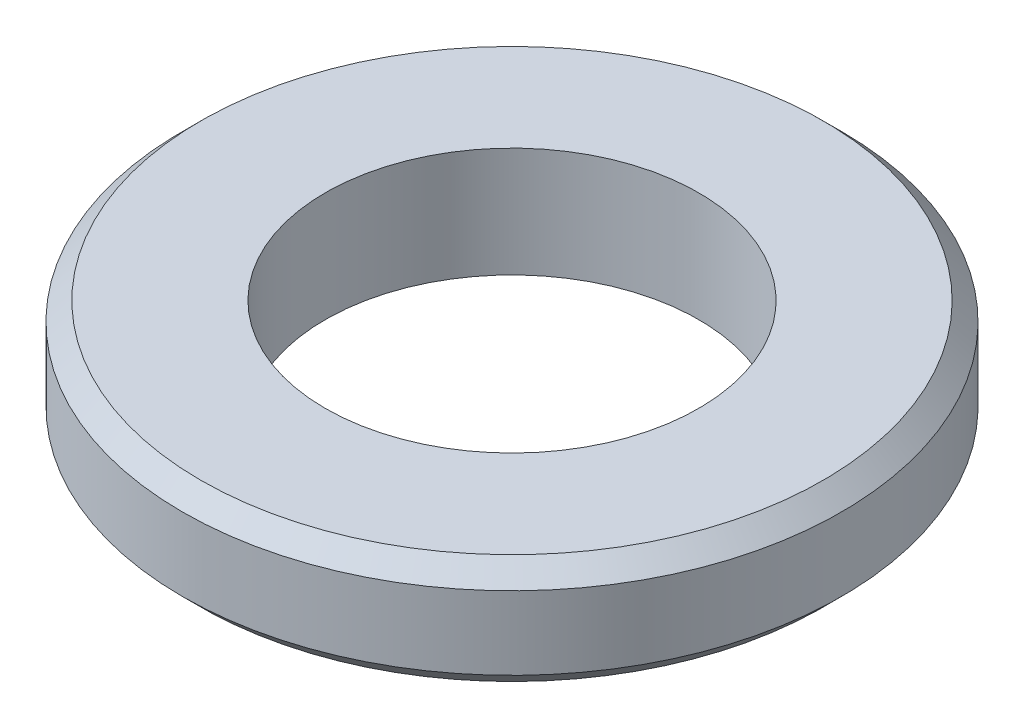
from build123d import *

# Parameters (mm, degrees)
ESQUISSE1_W        = 9
ESQUISSE1_H        = 3
TROU_TARAUD_M121_D = 10.2
CHANFREIN1_SIZE    = 0.5


with BuildPart() as part:
    # Esquisse1 → R_volution1 (revolve)
    with BuildSketch(Plane.XY, mode=Mode.PRIVATE) as r_volution1_sk:
        with Locations((-4.5, -1.61128311)):
            Rectangle(ESQUISSE1_W, ESQUISSE1_H)
    revolve(r_volution1_sk.sketch.rotate(Axis((0, 6.536895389, 0), (0, -1, 0)), 270), axis=Axis((0, 6.536895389, 0), (0, -1, 0)))

    # Trou taraud_ M121 (through all)
    with Locations(Plane(origin=(0, -0.11128311, 0), x_dir=(-1, 0, 0), z_dir=(0, 1, 0))):
        with Locations((0, 0)):
            Hole(TROU_TARAUD_M121_D / 2)

    # Chanfrein1
    chanfrein1_edges = [part.edges().sort_by_distance(p)[0] for p in [
        (0, -0.11128311, -9),
        (0, -3.11128311, -9),
    ]]
    chamfer(chanfrein1_edges, length=CHANFREIN1_SIZE)


solid = part.part
